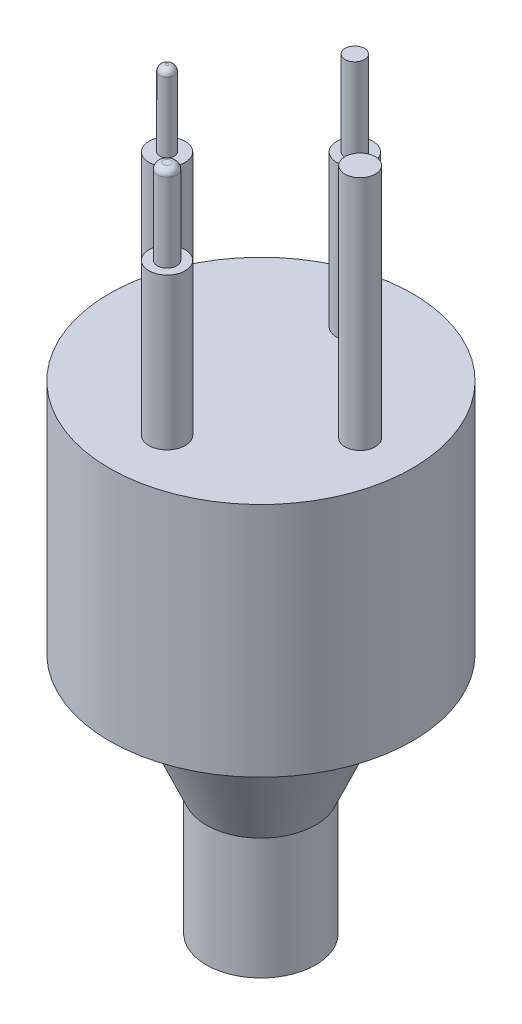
ISO-10303-21;
HEADER;
FILE_DESCRIPTION(('STEP AP214'),'2;1');
FILE_NAME('part.step','',(''),(''),'','','');
FILE_SCHEMA(('AUTOMOTIVE_DESIGN { 1 0 10303 214 1 1 1 1 }'));
ENDSEC;
DATA;
#1=APPLICATION_CONTEXT('core data for automotive mechanical design processes');
#2=APPLICATION_PROTOCOL_DEFINITION('international standard','automotive_design',2000,#1);
#3=PRODUCT_CONTEXT('',#1,'mechanical');
#4=PRODUCT('Part','Part','',(#3));
#5=PRODUCT_RELATED_PRODUCT_CATEGORY('part','',(#4));
#6=PRODUCT_DEFINITION_FORMATION('','',#4);
#7=PRODUCT_DEFINITION_CONTEXT('part definition',#1,'design');
#8=PRODUCT_DEFINITION('design','',#6,#7);
#9=PRODUCT_DEFINITION_SHAPE('','',#8);
#10=(LENGTH_UNIT() NAMED_UNIT(*) SI_UNIT(.MILLI.,.METRE.));
#11=(NAMED_UNIT(*) PLANE_ANGLE_UNIT() SI_UNIT($,.RADIAN.));
#12=(NAMED_UNIT(*) SI_UNIT($,.STERADIAN.) SOLID_ANGLE_UNIT());
#13=UNCERTAINTY_MEASURE_WITH_UNIT(LENGTH_MEASURE(1.E-05),#10,'distance_accuracy_value','');
#14=(GEOMETRIC_REPRESENTATION_CONTEXT(3) GLOBAL_UNCERTAINTY_ASSIGNED_CONTEXT((#13)) GLOBAL_UNIT_ASSIGNED_CONTEXT((#10,
#11,#12)) REPRESENTATION_CONTEXT('',''));
#15=CARTESIAN_POINT('',(0.,0.,0.));
#16=DIRECTION('',(0.,0.,1.));
#17=DIRECTION('',(1.,0.,0.));
#18=AXIS2_PLACEMENT_3D('',#15,#16,#17);
#19=CARTESIAN_POINT('',(-7.87399999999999,52.832,0.));
#20=DIRECTION('',(0.,1.,0.));
#21=DIRECTION('',(-1.,0.,0.));
#22=AXIS2_PLACEMENT_3D('',#19,#20,#21);
#23=PLANE('',#22);
#24=CARTESIAN_POINT('',(-7.87399999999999,52.832,0.));
#25=DIRECTION('',(0.,1.,0.));
#26=DIRECTION('',(-1.,0.,0.));
#27=AXIS2_PLACEMENT_3D('',#24,#25,#26);
#28=CIRCLE('',#27,1.524);
#29=CARTESIAN_POINT('',(-9.398,52.832,0.));
#30=VERTEX_POINT('',#29);
#31=EDGE_CURVE('E92',#30,#30,#28,.T.);
#32=ORIENTED_EDGE('',*,*,#31,.T.);
#33=EDGE_LOOP('',(#32));
#34=FACE_BOUND('',#33,.T.);
#35=CARTESIAN_POINT('',(-7.87399999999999,52.832,0.));
#36=DIRECTION('',(0.,1.,0.));
#37=DIRECTION('',(0.,0.,1.));
#38=AXIS2_PLACEMENT_3D('',#35,#36,#37);
#39=CIRCLE('',#38,0.616468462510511);
#40=CARTESIAN_POINT('',(-7.87399999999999,52.832,0.616468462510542));
#41=VERTEX_POINT('',#40);
#42=EDGE_CURVE('E98',#41,#41,#39,.T.);
#43=ORIENTED_EDGE('',*,*,#42,.F.);
#44=EDGE_LOOP('',(#43));
#45=FACE_BOUND('',#44,.T.);
#46=ADVANCED_FACE('F30',(#34,#45),#23,.T.);
#47=CARTESIAN_POINT('',(-12.7000000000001,40.132,0.));
#48=DIRECTION('',(0.,1.,0.));
#49=DIRECTION('',(0.,0.,1.));
#50=AXIS2_PLACEMENT_3D('',#47,#48,#49);
#51=PLANE('',#50);
#52=CARTESIAN_POINT('',(8.316893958,40.132,0.));
#53=DIRECTION('',(0.,1.,0.));
#54=DIRECTION('',(0.,0.,1.));
#55=AXIS2_PLACEMENT_3D('',#52,#53,#54);
#56=CIRCLE('',#55,1.27);
#57=CARTESIAN_POINT('',(8.316893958,40.132,1.27000000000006));
#58=VERTEX_POINT('',#57);
#59=EDGE_CURVE('E89',#58,#58,#56,.T.);
#60=ORIENTED_EDGE('',*,*,#59,.F.);
#61=EDGE_LOOP('',(#60));
#62=FACE_BOUND('',#61,.T.);
#63=CARTESIAN_POINT('',(0.,40.132,-7.87399999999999));
#64=DIRECTION('',(0.,1.,0.));
#65=DIRECTION('',(0.,0.,1.));
#66=AXIS2_PLACEMENT_3D('',#63,#64,#65);
#67=CIRCLE('',#66,1.524);
#68=CARTESIAN_POINT('',(0.,40.132,-6.34999999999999));
#69=VERTEX_POINT('',#68);
#70=EDGE_CURVE('E45',#69,#69,#67,.T.);
#71=ORIENTED_EDGE('',*,*,#70,.F.);
#72=EDGE_LOOP('',(#71));
#73=FACE_BOUND('',#72,.T.);
#74=CARTESIAN_POINT('',(0.,40.132,0.));
#75=DIRECTION('',(0.,1.,0.));
#76=DIRECTION('',(0.,0.,1.));
#77=AXIS2_PLACEMENT_3D('',#74,#75,#76);
#78=CIRCLE('',#77,12.7);
#79=CARTESIAN_POINT('',(0.,40.132,12.7000000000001));
#80=VERTEX_POINT('',#79);
#81=EDGE_CURVE('E56',#80,#80,#78,.T.);
#82=ORIENTED_EDGE('',*,*,#81,.T.);
#83=EDGE_LOOP('',(#82));
#84=FACE_BOUND('',#83,.T.);
#85=CARTESIAN_POINT('',(0.,40.132,7.87400000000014));
#86=DIRECTION('',(0.,1.,0.));
#87=DIRECTION('',(0.,0.,1.));
#88=AXIS2_PLACEMENT_3D('',#85,#86,#87);
#89=CIRCLE('',#88,1.524);
#90=CARTESIAN_POINT('',(0.,40.132,9.39800000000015));
#91=VERTEX_POINT('',#90);
#92=EDGE_CURVE('E74',#91,#91,#89,.T.);
#93=ORIENTED_EDGE('',*,*,#92,.F.);
#94=EDGE_LOOP('',(#93));
#95=FACE_BOUND('',#94,.T.);
#96=CARTESIAN_POINT('',(-7.87399999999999,40.132,0.));
#97=DIRECTION('',(0.,1.,0.));
#98=DIRECTION('',(-1.,0.,0.));
#99=AXIS2_PLACEMENT_3D('',#96,#97,#98);
#100=CIRCLE('',#99,1.524);
#101=CARTESIAN_POINT('',(-9.398,40.132,0.));
#102=VERTEX_POINT('',#101);
#103=EDGE_CURVE('E95',#102,#102,#100,.T.);
#104=ORIENTED_EDGE('',*,*,#103,.F.);
#105=EDGE_LOOP('',(#104));
#106=FACE_BOUND('',#105,.T.);
#107=ADVANCED_FACE('F32',(#62,#73,#84,#95,#106),#51,.T.);
#108=CARTESIAN_POINT('',(0.,52.832,7.87400000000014));
#109=DIRECTION('',(0.,1.,0.));
#110=DIRECTION('',(0.,0.,1.));
#111=AXIS2_PLACEMENT_3D('',#108,#109,#110);
#112=PLANE('',#111);
#113=CARTESIAN_POINT('',(0.,52.832,7.87400000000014));
#114=DIRECTION('',(0.,1.,0.));
#115=DIRECTION('',(0.,0.,1.));
#116=AXIS2_PLACEMENT_3D('',#113,#114,#115);
#117=CIRCLE('',#116,1.524);
#118=CARTESIAN_POINT('',(0.,52.832,9.39800000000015));
#119=VERTEX_POINT('',#118);
#120=EDGE_CURVE('E71',#119,#119,#117,.T.);
#121=ORIENTED_EDGE('',*,*,#120,.T.);
#122=EDGE_LOOP('',(#121));
#123=FACE_BOUND('',#122,.T.);
#124=CARTESIAN_POINT('',(0.,52.832,7.87400000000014));
#125=DIRECTION('',(0.,1.,0.));
#126=DIRECTION('',(0.,0.,1.));
#127=AXIS2_PLACEMENT_3D('',#124,#125,#126);
#128=CIRCLE('',#127,0.81382489);
#129=CARTESIAN_POINT('',(0.,52.832,8.68782489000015));
#130=VERTEX_POINT('',#129);
#131=EDGE_CURVE('E77',#130,#130,#128,.T.);
#132=ORIENTED_EDGE('',*,*,#131,.F.);
#133=EDGE_LOOP('',(#132));
#134=FACE_BOUND('',#133,.T.);
#135=ADVANCED_FACE('F110',(#123,#134),#112,.T.);
#136=CARTESIAN_POINT('',(0.,55.728152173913,0.));
#137=DIRECTION('',(0.,1.,0.));
#138=DIRECTION('',(0.,0.,1.));
#139=AXIS2_PLACEMENT_3D('',#136,#137,#138);
#140=CYLINDRICAL_SURFACE('',#139,12.7);
#141=CARTESIAN_POINT('',(0.,20.32,0.));
#142=DIRECTION('',(0.,1.,0.));
#143=DIRECTION('',(0.,0.,1.));
#144=AXIS2_PLACEMENT_3D('',#141,#142,#143);
#145=CIRCLE('',#144,12.7);
#146=CARTESIAN_POINT('',(0.,20.32,12.7));
#147=VERTEX_POINT('',#146);
#148=EDGE_CURVE('E59',#147,#147,#145,.T.);
#149=ORIENTED_EDGE('',*,*,#148,.T.);
#150=EDGE_LOOP('',(#149));
#151=FACE_BOUND('',#150,.T.);
#152=ORIENTED_EDGE('',*,*,#81,.F.);
#153=EDGE_LOOP('',(#152));
#154=FACE_BOUND('',#153,.T.);
#155=ADVANCED_FACE('F158',(#151,#154),#140,.T.);
#156=CARTESIAN_POINT('',(-9.01502108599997,20.32,0.));
#157=DIRECTION('',(0.,-1.,0.));
#158=DIRECTION('',(0.,0.,-1.));
#159=AXIS2_PLACEMENT_3D('',#156,#157,#158);
#160=PLANE('',#159);
#161=CARTESIAN_POINT('',(0.,20.32,0.));
#162=DIRECTION('',(0.,1.,0.));
#163=DIRECTION('',(0.,0.,1.));
#164=AXIS2_PLACEMENT_3D('',#161,#162,#163);
#165=CIRCLE('',#164,9.015021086);
#166=CARTESIAN_POINT('',(0.,20.32,9.01502108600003));
#167=VERTEX_POINT('',#166);
#168=EDGE_CURVE('E62',#167,#167,#165,.T.);
#169=ORIENTED_EDGE('',*,*,#168,.T.);
#170=EDGE_LOOP('',(#169));
#171=FACE_BOUND('',#170,.T.);
#172=ORIENTED_EDGE('',*,*,#148,.F.);
#173=EDGE_LOOP('',(#172));
#174=FACE_BOUND('',#173,.T.);
#175=ADVANCED_FACE('F174',(#171,#174),#160,.T.);
#176=CARTESIAN_POINT('',(0.,20.32,0.));
#177=DIRECTION('',(0.,1.,0.));
#178=DIRECTION('',(0.,0.,1.));
#179=AXIS2_PLACEMENT_3D('',#176,#177,#178);
#180=CONICAL_SURFACE('',#179,9.015021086,0.411336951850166);
#181=CARTESIAN_POINT('',(0.,10.16,0.));
#182=DIRECTION('',(0.,1.,0.));
#183=DIRECTION('',(0.,0.,1.));
#184=AXIS2_PLACEMENT_3D('',#181,#182,#183);
#185=CIRCLE('',#184,4.583009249);
#186=CARTESIAN_POINT('',(0.,10.16,4.58300924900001));
#187=VERTEX_POINT('',#186);
#188=EDGE_CURVE('E65',#187,#187,#185,.T.);
#189=ORIENTED_EDGE('',*,*,#188,.T.);
#190=EDGE_LOOP('',(#189));
#191=FACE_BOUND('',#190,.T.);
#192=ORIENTED_EDGE('',*,*,#168,.F.);
#193=EDGE_LOOP('',(#192));
#194=FACE_BOUND('',#193,.T.);
#195=ADVANCED_FACE('F170',(#191,#194),#180,.T.);
#196=CARTESIAN_POINT('',(0.,55.728152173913,0.));
#197=DIRECTION('',(0.,1.,0.));
#198=DIRECTION('',(0.,0.,1.));
#199=AXIS2_PLACEMENT_3D('',#196,#197,#198);
#200=CYLINDRICAL_SURFACE('',#199,4.583009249);
#201=CARTESIAN_POINT('',(0.,0.,0.));
#202=DIRECTION('',(0.,1.,0.));
#203=DIRECTION('',(0.,0.,1.));
#204=AXIS2_PLACEMENT_3D('',#201,#202,#203);
#205=CIRCLE('',#204,4.58300924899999);
#206=CARTESIAN_POINT('',(0.,0.,4.58300924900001));
#207=VERTEX_POINT('',#206);
#208=EDGE_CURVE('E68',#207,#207,#205,.T.);
#209=ORIENTED_EDGE('',*,*,#208,.T.);
#210=EDGE_LOOP('',(#209));
#211=FACE_BOUND('',#210,.T.);
#212=ORIENTED_EDGE('',*,*,#188,.F.);
#213=EDGE_LOOP('',(#212));
#214=FACE_BOUND('',#213,.T.);
#215=ADVANCED_FACE('F166',(#211,#214),#200,.T.);
#216=CARTESIAN_POINT('',(0.,0.,0.));
#217=DIRECTION('',(0.,-1.,0.));
#218=DIRECTION('',(0.,0.,-1.));
#219=AXIS2_PLACEMENT_3D('',#216,#217,#218);
#220=PLANE('',#219);
#221=ORIENTED_EDGE('',*,*,#208,.F.);
#222=EDGE_LOOP('',(#221));
#223=FACE_BOUND('',#222,.T.);
#224=ADVANCED_FACE('F162',(#223),#220,.T.);
#225=CARTESIAN_POINT('',(0.,52.832,7.87400000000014));
#226=DIRECTION('',(0.,-1.,0.));
#227=DIRECTION('',(0.,0.,-1.));
#228=AXIS2_PLACEMENT_3D('',#225,#226,#227);
#229=CYLINDRICAL_SURFACE('',#228,1.524);
#230=ORIENTED_EDGE('',*,*,#120,.F.);
#231=EDGE_LOOP('',(#230));
#232=FACE_BOUND('',#231,.T.);
#233=ORIENTED_EDGE('',*,*,#92,.T.);
#234=EDGE_LOOP('',(#233));
#235=FACE_BOUND('',#234,.T.);
#236=ADVANCED_FACE('F154',(#232,#235),#229,.T.);
#237=CARTESIAN_POINT('',(0.,59.944,7.87400000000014));
#238=DIRECTION('',(0.,-1.,0.));
#239=DIRECTION('',(0.,0.,-1.));
#240=AXIS2_PLACEMENT_3D('',#237,#238,#239);
#241=CYLINDRICAL_SURFACE('',#240,0.81382489);
#242=CARTESIAN_POINT('',(0.,59.436,7.87400000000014));
#243=DIRECTION('',(0.,1.,0.));
#244=DIRECTION('',(0.,0.,1.));
#245=AXIS2_PLACEMENT_3D('',#242,#243,#244);
#246=CIRCLE('',#245,0.81382489);
#247=CARTESIAN_POINT('',(0.,59.436,8.68782489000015));
#248=VERTEX_POINT('',#247);
#249=EDGE_CURVE('E50',#248,#248,#246,.F.);
#250=ORIENTED_EDGE('',*,*,#249,.T.);
#251=EDGE_LOOP('',(#250));
#252=FACE_BOUND('',#251,.T.);
#253=ORIENTED_EDGE('',*,*,#131,.T.);
#254=EDGE_LOOP('',(#253));
#255=FACE_BOUND('',#254,.T.);
#256=ADVANCED_FACE('F150',(#252,#255),#241,.T.);
#257=CARTESIAN_POINT('',(0.,59.944,7.87400000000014));
#258=DIRECTION('',(0.,1.,0.));
#259=DIRECTION('',(0.,0.,1.));
#260=AXIS2_PLACEMENT_3D('',#257,#258,#259);
#261=PLANE('',#260);
#262=CARTESIAN_POINT('',(0.,59.944,7.87400000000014));
#263=DIRECTION('',(0.,1.,0.));
#264=DIRECTION('',(0.,0.,1.));
#265=AXIS2_PLACEMENT_3D('',#262,#263,#264);
#266=CIRCLE('',#265,0.30582489);
#267=CARTESIAN_POINT('',(0.,59.944,8.17982489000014));
#268=VERTEX_POINT('',#267);
#269=EDGE_CURVE('E53',#268,#268,#266,.T.);
#270=ORIENTED_EDGE('',*,*,#269,.T.);
#271=EDGE_LOOP('',(#270));
#272=FACE_BOUND('',#271,.T.);
#273=ADVANCED_FACE('F146',(#272),#261,.T.);
#274=CARTESIAN_POINT('',(0.,59.436,7.87400000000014));
#275=DIRECTION('',(0.,1.,0.));
#276=DIRECTION('',(0.,0.,1.));
#277=AXIS2_PLACEMENT_3D('',#274,#275,#276);
#278=DEGENERATE_TOROIDAL_SURFACE('',#277,0.30582489,0.508,.T.);
#279=ORIENTED_EDGE('',*,*,#249,.F.);
#280=EDGE_LOOP('',(#279));
#281=FACE_BOUND('',#280,.T.);
#282=ORIENTED_EDGE('',*,*,#269,.F.);
#283=EDGE_LOOP('',(#282));
#284=FACE_BOUND('',#283,.T.);
#285=ADVANCED_FACE('F142',(#281,#284),#278,.T.);
#286=CARTESIAN_POINT('',(0.,52.832,-7.87399999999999));
#287=DIRECTION('',(0.,-1.,0.));
#288=DIRECTION('',(0.,0.,-1.));
#289=AXIS2_PLACEMENT_3D('',#286,#287,#288);
#290=CYLINDRICAL_SURFACE('',#289,1.524);
#291=CARTESIAN_POINT('',(0.,52.832,-7.87399999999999));
#292=DIRECTION('',(0.,-1.,0.));
#293=DIRECTION('',(0.,0.,-1.));
#294=AXIS2_PLACEMENT_3D('',#291,#292,#293);
#295=CIRCLE('',#294,1.524);
#296=CARTESIAN_POINT('',(0.,52.832,-9.398));
#297=VERTEX_POINT('',#296);
#298=EDGE_CURVE('E80',#297,#297,#295,.T.);
#299=ORIENTED_EDGE('',*,*,#298,.T.);
#300=EDGE_LOOP('',(#299));
#301=FACE_BOUND('',#300,.T.);
#302=ORIENTED_EDGE('',*,*,#70,.T.);
#303=EDGE_LOOP('',(#302));
#304=FACE_BOUND('',#303,.T.);
#305=ADVANCED_FACE('F138',(#301,#304),#290,.T.);
#306=CARTESIAN_POINT('',(0.,52.832,-7.87399999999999));
#307=DIRECTION('',(0.,1.,0.));
#308=DIRECTION('',(0.,0.,-1.));
#309=AXIS2_PLACEMENT_3D('',#306,#307,#308);
#310=PLANE('',#309);
#311=CARTESIAN_POINT('',(0.,52.832,-7.87399999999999));
#312=DIRECTION('',(0.,1.,0.));
#313=DIRECTION('',(0.,0.,1.));
#314=AXIS2_PLACEMENT_3D('',#311,#312,#313);
#315=CIRCLE('',#314,0.81382489);
#316=CARTESIAN_POINT('',(0.,52.832,-7.06017510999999));
#317=VERTEX_POINT('',#316);
#318=EDGE_CURVE('E41',#317,#317,#315,.T.);
#319=ORIENTED_EDGE('',*,*,#318,.F.);
#320=EDGE_LOOP('',(#319));
#321=FACE_BOUND('',#320,.T.);
#322=ORIENTED_EDGE('',*,*,#298,.F.);
#323=EDGE_LOOP('',(#322));
#324=FACE_BOUND('',#323,.T.);
#325=ADVANCED_FACE('F134',(#321,#324),#310,.T.);
#326=CARTESIAN_POINT('',(0.,59.944,-7.87399999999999));
#327=DIRECTION('',(0.,-1.,0.));
#328=DIRECTION('',(0.,0.,-1.));
#329=AXIS2_PLACEMENT_3D('',#326,#327,#328);
#330=CYLINDRICAL_SURFACE('',#329,0.81382489);
#331=CARTESIAN_POINT('',(0.,59.944,-7.87399999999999));
#332=DIRECTION('',(0.,-1.,0.));
#333=DIRECTION('',(0.,0.,-1.));
#334=AXIS2_PLACEMENT_3D('',#331,#332,#333);
#335=CIRCLE('',#334,0.81382489);
#336=CARTESIAN_POINT('',(0.,59.944,-8.68782489));
#337=VERTEX_POINT('',#336);
#338=EDGE_CURVE('E83',#337,#337,#335,.T.);
#339=ORIENTED_EDGE('',*,*,#338,.T.);
#340=EDGE_LOOP('',(#339));
#341=FACE_BOUND('',#340,.T.);
#342=ORIENTED_EDGE('',*,*,#318,.T.);
#343=EDGE_LOOP('',(#342));
#344=FACE_BOUND('',#343,.T.);
#345=ADVANCED_FACE('F130',(#341,#344),#330,.T.);
#346=CARTESIAN_POINT('',(0.,59.944,-7.87399999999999));
#347=DIRECTION('',(0.,1.,0.));
#348=DIRECTION('',(0.,0.,-1.));
#349=AXIS2_PLACEMENT_3D('',#346,#347,#348);
#350=PLANE('',#349);
#351=ORIENTED_EDGE('',*,*,#338,.F.);
#352=EDGE_LOOP('',(#351));
#353=FACE_BOUND('',#352,.T.);
#354=ADVANCED_FACE('F126',(#353),#350,.T.);
#355=CARTESIAN_POINT('',(8.316893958,59.944,0.));
#356=DIRECTION('',(0.,-1.,0.));
#357=DIRECTION('',(0.,0.,-1.));
#358=AXIS2_PLACEMENT_3D('',#355,#356,#357);
#359=CYLINDRICAL_SURFACE('',#358,1.27);
#360=CARTESIAN_POINT('',(8.316893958,59.944,0.));
#361=DIRECTION('',(0.,1.,0.));
#362=DIRECTION('',(0.,0.,1.));
#363=AXIS2_PLACEMENT_3D('',#360,#361,#362);
#364=CIRCLE('',#363,1.27);
#365=CARTESIAN_POINT('',(8.316893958,59.944,1.27000000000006));
#366=VERTEX_POINT('',#365);
#367=EDGE_CURVE('E86',#366,#366,#364,.T.);
#368=ORIENTED_EDGE('',*,*,#367,.F.);
#369=EDGE_LOOP('',(#368));
#370=FACE_BOUND('',#369,.T.);
#371=ORIENTED_EDGE('',*,*,#59,.T.);
#372=EDGE_LOOP('',(#371));
#373=FACE_BOUND('',#372,.T.);
#374=ADVANCED_FACE('F122',(#370,#373),#359,.T.);
#375=CARTESIAN_POINT('',(8.316893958,59.944,0.));
#376=DIRECTION('',(0.,1.,0.));
#377=DIRECTION('',(0.,0.,1.));
#378=AXIS2_PLACEMENT_3D('',#375,#376,#377);
#379=PLANE('',#378);
#380=ORIENTED_EDGE('',*,*,#367,.T.);
#381=EDGE_LOOP('',(#380));
#382=FACE_BOUND('',#381,.T.);
#383=ADVANCED_FACE('F118',(#382),#379,.T.);
#384=CARTESIAN_POINT('',(-7.87399999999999,52.832,0.));
#385=DIRECTION('',(0.,-1.,0.));
#386=DIRECTION('',(1.,0.,0.));
#387=AXIS2_PLACEMENT_3D('',#384,#385,#386);
#388=CYLINDRICAL_SURFACE('',#387,1.524);
#389=ORIENTED_EDGE('',*,*,#31,.F.);
#390=EDGE_LOOP('',(#389));
#391=FACE_BOUND('',#390,.T.);
#392=ORIENTED_EDGE('',*,*,#103,.T.);
#393=EDGE_LOOP('',(#392));
#394=FACE_BOUND('',#393,.T.);
#395=ADVANCED_FACE('F115',(#391,#394),#388,.T.);
#396=CARTESIAN_POINT('',(-7.87399999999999,59.182,0.));
#397=DIRECTION('',(0.,-1.,0.));
#398=DIRECTION('',(0.,0.,-1.));
#399=AXIS2_PLACEMENT_3D('',#396,#397,#398);
#400=CYLINDRICAL_SURFACE('',#399,0.616468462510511);
#401=CARTESIAN_POINT('',(-7.87399999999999,58.674,0.));
#402=DIRECTION('',(0.,1.,0.));
#403=DIRECTION('',(0.,0.,1.));
#404=AXIS2_PLACEMENT_3D('',#401,#402,#403);
#405=CIRCLE('',#404,0.616468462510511);
#406=CARTESIAN_POINT('',(-7.87399999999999,58.674,0.616468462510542));
#407=VERTEX_POINT('',#406);
#408=EDGE_CURVE('E10',#407,#407,#405,.F.);
#409=ORIENTED_EDGE('',*,*,#408,.T.);
#410=EDGE_LOOP('',(#409));
#411=FACE_BOUND('',#410,.T.);
#412=ORIENTED_EDGE('',*,*,#42,.T.);
#413=EDGE_LOOP('',(#412));
#414=FACE_BOUND('',#413,.T.);
#415=ADVANCED_FACE('F102',(#411,#414),#400,.T.);
#416=CARTESIAN_POINT('',(-7.87399999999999,59.182,0.));
#417=DIRECTION('',(0.,1.,0.));
#418=DIRECTION('',(0.,0.,1.));
#419=AXIS2_PLACEMENT_3D('',#416,#417,#418);
#420=PLANE('',#419);
#421=CARTESIAN_POINT('',(-7.87399999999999,59.182,0.));
#422=DIRECTION('',(0.,1.,0.));
#423=DIRECTION('',(0.,0.,1.));
#424=AXIS2_PLACEMENT_3D('',#421,#422,#423);
#425=CIRCLE('',#424,0.108468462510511);
#426=CARTESIAN_POINT('',(-7.87399999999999,59.182,0.10846846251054));
#427=VERTEX_POINT('',#426);
#428=EDGE_CURVE('E37',#427,#427,#425,.T.);
#429=ORIENTED_EDGE('',*,*,#428,.T.);
#430=EDGE_LOOP('',(#429));
#431=FACE_BOUND('',#430,.T.);
#432=ADVANCED_FACE('F261',(#431),#420,.T.);
#433=CARTESIAN_POINT('',(-7.87399999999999,58.674,0.));
#434=DIRECTION('',(0.,1.,0.));
#435=DIRECTION('',(0.,0.,1.));
#436=AXIS2_PLACEMENT_3D('',#433,#434,#435);
#437=DEGENERATE_TOROIDAL_SURFACE('',#436,0.108468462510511,0.508,.T.);
#438=ORIENTED_EDGE('',*,*,#408,.F.);
#439=EDGE_LOOP('',(#438));
#440=FACE_BOUND('',#439,.T.);
#441=ORIENTED_EDGE('',*,*,#428,.F.);
#442=EDGE_LOOP('',(#441));
#443=FACE_BOUND('',#442,.T.);
#444=ADVANCED_FACE('F267',(#440,#443),#437,.T.);
#445=CLOSED_SHELL('',(#46,#107,#135,#155,#175,#195,#215,#224,#236,#256,#273,#285,#305,#325,#345,
#354,#374,#383,#395,#415,#432,#444));
#446=MANIFOLD_SOLID_BREP('B2',#445);
#447=ADVANCED_BREP_SHAPE_REPRESENTATION('',(#18,#446),#14);
#448=SHAPE_DEFINITION_REPRESENTATION(#9,#447);
ENDSEC;
END-ISO-10303-21;
